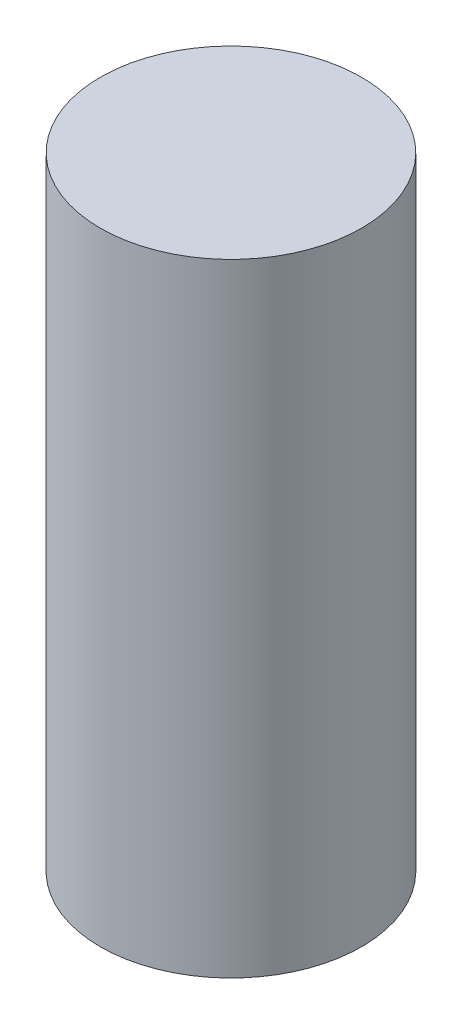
from build123d import *

# Parameters (mm, degrees)
SKETCH1_W = 3.15
SKETCH1_H = 15


with BuildPart() as part:
    # Sketch1 → Revolve1 (revolve)
    with BuildSketch(Plane(origin=(0, 0, 0), x_dir=(0, 0, -1), z_dir=(1, 0, 0)), mode=Mode.PRIVATE) as revolve1_sk:
        with Locations((1.575, -7.5)):
            Rectangle(SKETCH1_W, SKETCH1_H)
    revolve(revolve1_sk.sketch.rotate(Axis((0, 28.688475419, 0), (0, -1, 0)), 180), axis=Axis((0, 28.688475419, 0), (0, -1, 0)))


solid = part.part
